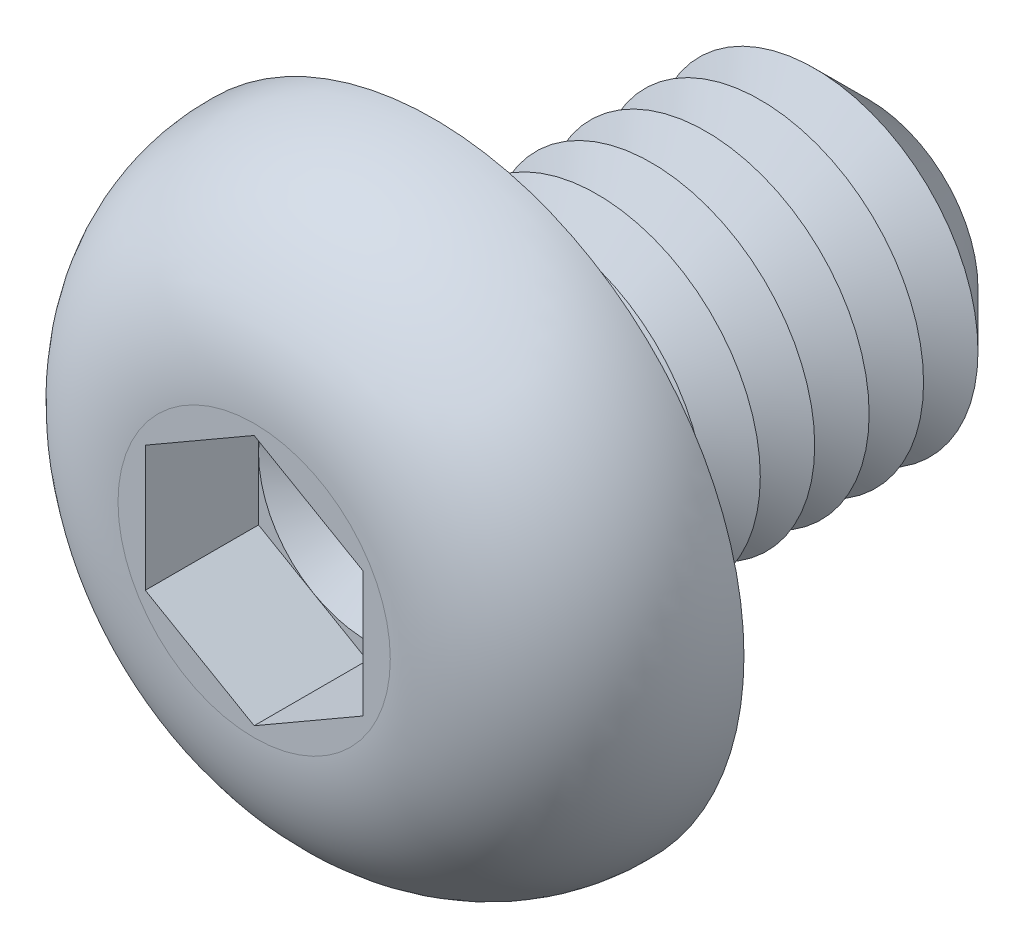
from build123d import *

# Parameters (mm, degrees)
CUT_EXTRUDE1_DEPTH  = 1.04
SKETCH4_R           = 1.5
BOSS_EXTRUDE1_DEPTH = 4
CHAMFER1_SIZE       = 0.5
LPATTERN1_COUNT     = 6
LPATTERN1_PITCH     = 0.5
FILLET2_R           = 0.2


with BuildPart() as part:
    # Sketch2 → Revolve1 (revolve)
    with BuildSketch(Plane(origin=(0, 0, 0), x_dir=(0, 0, -1), z_dir=(1, 0, 0)), mode=Mode.PRIVATE) as revolve1_sk:
        with BuildLine():
            Line((0, 0), (-1.65, 0))
            Line((-1.65, 0), (-1.65, 1.250781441))
            ThreePointArc((-1.65, 1.250781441), (-1.163552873, 2.39969397), (0, 2.85))
            Line((0, 2.85), (0, 0))
        make_face()
    revolve(revolve1_sk.sketch.rotate(Axis((0, 0, 47.934239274), (0, 0, -1)), 90), axis=Axis((0, 0, 47.934239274), (0, 0, -1)))

    # Sketch3 → Cut-Extrude1 (cut)
    with BuildSketch(Plane.XY.offset(1.65)):
        Polygon((0, 1.154700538), (-1, 0.577350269), (-1, -0.577350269), (0, -1.154700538), (1, -0.577350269), (1, 0.577350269), align=None)
    extrude(amount=-CUT_EXTRUDE1_DEPTH, mode=Mode.SUBTRACT)

    # Sketch4 → Boss-Extrude1 (add)
    with BuildSketch(Plane(origin=(0, 0, 0), x_dir=(-1, 0, 0), z_dir=(0, 0, -1))):
        with Locations(Location((0, 0, 0), (0, 0, 180))):
            Circle(SKETCH4_R)
    extrude(amount=BOSS_EXTRUDE1_DEPTH)

    # Chamfer1
    chamfer1_edges = [part.edges().sort_by_distance(p)[0] for p in [
        (-1.5, 0, -4),
    ]]
    chamfer(chamfer1_edges, length=CHAMFER1_SIZE)

    # Sketch5 → Cut-Revolve1 (revolve, cut)
    with BuildSketch(Plane(origin=(0, 0, 0), x_dir=(0, 0, -1), z_dir=(1, 0, 0)), mode=Mode.PRIVATE) as cut_revolve1_sk:
        Polygon((0.5, 1.5), (1, 1.5), (0.75, 1.066987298), align=None)
    cut_revolve1 = revolve(cut_revolve1_sk.sketch.rotate(Axis((0, 0, 47.934239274), (0, 0, -1)), 90), axis=Axis((0, 0, 47.934239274), (0, 0, -1)), mode=Mode.SUBTRACT)

    # LPattern1: Cut-Revolve1 ×6
    with Locations(*[(0, 0, -i * LPATTERN1_PITCH) for i in range(1, LPATTERN1_COUNT)]):
        add(cut_revolve1, mode=Mode.SUBTRACT)

    # Fillet2
    fillet2_edges = [part.edges().sort_by_distance(p)[0] for p in [
        (-1.5, 0, 0),
    ]]
    fillet(fillet2_edges, radius=FILLET2_R)

    # Cut-Extrude2 cone 1 section (on through the dimple's axis) → Cut-Extrude2 (revolve, cut)
    with BuildSketch(Plane(origin=(0, 0, 0.61), x_dir=(0, -1, 0), z_dir=(1, 0, 0))):
        Polygon((0, 0), (1, 0), (0, 0.577350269), align=None)
    revolve(axis=Axis((0, 0, 0.61), (0, 0, -1)), mode=Mode.SUBTRACT)


solid = part.part
